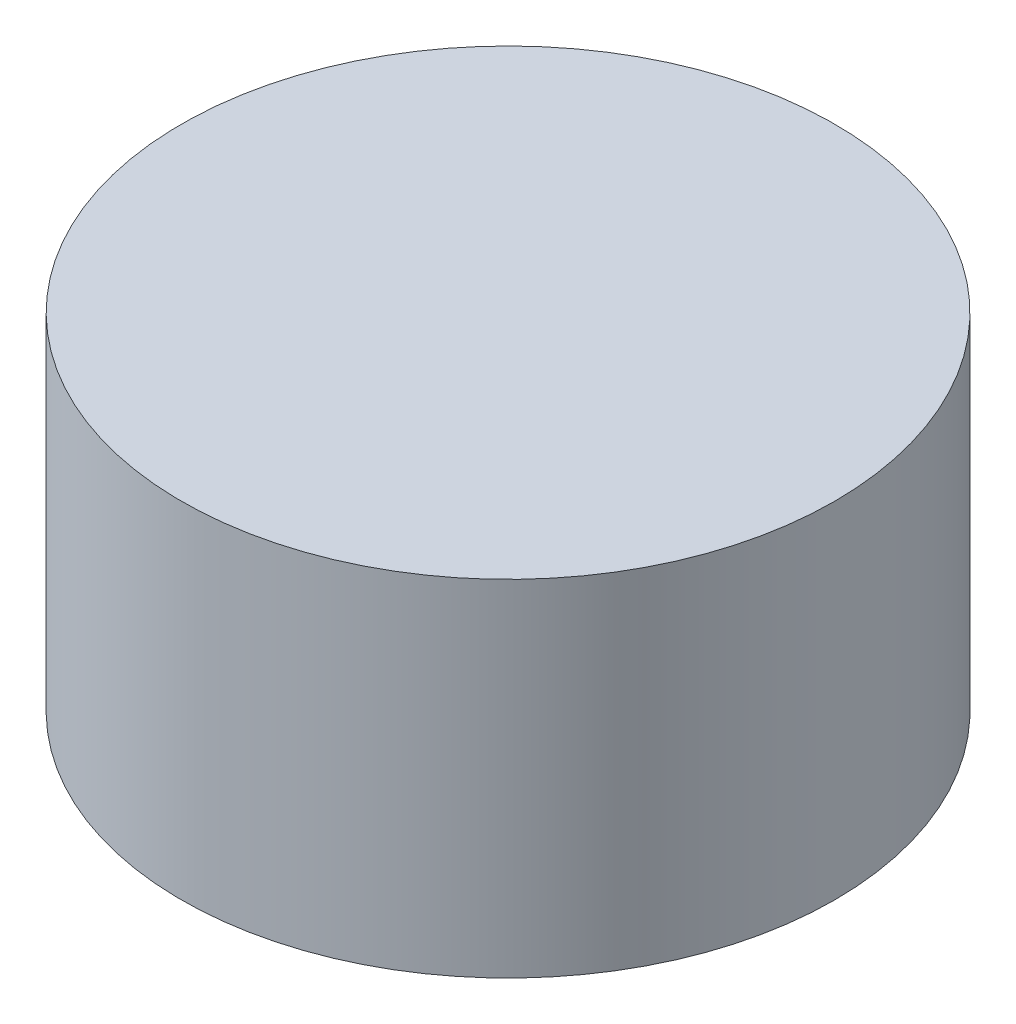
from build123d import *


with BuildPart() as part:
    # Esquisse1 → R_volution1 (revolve)
    with BuildSketch(Plane.XY, mode=Mode.PRIVATE) as r_volution1_sk:
        Polygon((-1.5, 0), (-1.75, 0), (-1.75, 1.85), (0, 1.85), (0, 1.327350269), (-1, 0.75), (-1.5, 0.75), align=None)
    revolve(r_volution1_sk.sketch.rotate(Axis((0, 0, 0), (0, 1, 0)), 180), axis=Axis((0, 0, 0), (0, 1, 0)))


solid = part.part
